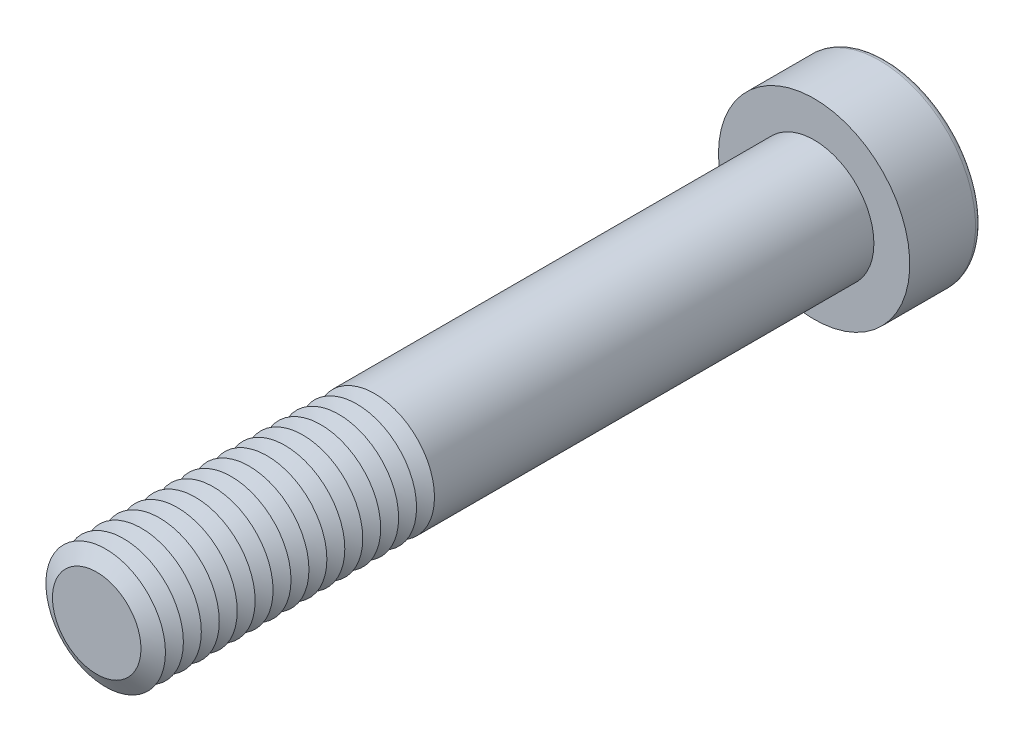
ISO-10303-21;
HEADER;
FILE_DESCRIPTION(('STEP AP214'),'2;1');
FILE_NAME('part.step','',(''),(''),'','','');
FILE_SCHEMA(('AUTOMOTIVE_DESIGN { 1 0 10303 214 1 1 1 1 }'));
ENDSEC;
DATA;
#1=APPLICATION_CONTEXT('core data for automotive mechanical design processes');
#2=APPLICATION_PROTOCOL_DEFINITION('international standard','automotive_design',2000,#1);
#3=PRODUCT_CONTEXT('',#1,'mechanical');
#4=PRODUCT('Part','Part','',(#3));
#5=PRODUCT_RELATED_PRODUCT_CATEGORY('part','',(#4));
#6=PRODUCT_DEFINITION_FORMATION('','',#4);
#7=PRODUCT_DEFINITION_CONTEXT('part definition',#1,'design');
#8=PRODUCT_DEFINITION('design','',#6,#7);
#9=PRODUCT_DEFINITION_SHAPE('','',#8);
#10=(LENGTH_UNIT() NAMED_UNIT(*) SI_UNIT(.MILLI.,.METRE.));
#11=(NAMED_UNIT(*) PLANE_ANGLE_UNIT() SI_UNIT($,.RADIAN.));
#12=(NAMED_UNIT(*) SI_UNIT($,.STERADIAN.) SOLID_ANGLE_UNIT());
#13=UNCERTAINTY_MEASURE_WITH_UNIT(LENGTH_MEASURE(1.E-05),#10,'distance_accuracy_value','');
#14=(GEOMETRIC_REPRESENTATION_CONTEXT(3) GLOBAL_UNCERTAINTY_ASSIGNED_CONTEXT((#13)) GLOBAL_UNIT_ASSIGNED_CONTEXT((#10,
#11,#12)) REPRESENTATION_CONTEXT('',''));
#15=CARTESIAN_POINT('',(0.,0.,0.));
#16=DIRECTION('',(0.,0.,1.));
#17=DIRECTION('',(1.,0.,0.));
#18=AXIS2_PLACEMENT_3D('',#15,#16,#17);
#19=CARTESIAN_POINT('',(0.,0.,54.75));
#20=DIRECTION('',(0.,0.,1.));
#21=DIRECTION('',(1.,0.,0.));
#22=AXIS2_PLACEMENT_3D('',#19,#20,#21);
#23=CONICAL_SURFACE('',#22,5.,1.0471975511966);
#24=CARTESIAN_POINT('',(0.,0.,54.));
#25=DIRECTION('',(0.,0.,1.));
#26=DIRECTION('',(1.,0.,0.));
#27=AXIS2_PLACEMENT_3D('',#24,#25,#26);
#28=CIRCLE('',#27,3.70096189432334);
#29=CARTESIAN_POINT('',(3.70096189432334,0.,54.));
#30=VERTEX_POINT('',#29);
#31=EDGE_CURVE('E313',#30,#30,#28,.T.);
#32=ORIENTED_EDGE('',*,*,#31,.T.);
#33=EDGE_LOOP('',(#32));
#34=FACE_BOUND('',#33,.T.);
#35=CARTESIAN_POINT('',(0.,0.,54.75));
#36=DIRECTION('',(0.,0.,1.));
#37=DIRECTION('',(1.,0.,0.));
#38=AXIS2_PLACEMENT_3D('',#35,#36,#37);
#39=CIRCLE('',#38,5.);
#40=CARTESIAN_POINT('',(5.,0.,54.75));
#41=VERTEX_POINT('',#40);
#42=EDGE_CURVE('E316',#41,#41,#39,.T.);
#43=ORIENTED_EDGE('',*,*,#42,.F.);
#44=EDGE_LOOP('',(#43));
#45=FACE_BOUND('',#44,.T.);
#46=ADVANCED_FACE('F39',(#34,#45),#23,.T.);
#47=CARTESIAN_POINT('',(0.,0.,54.));
#48=DIRECTION('',(0.,0.,-1.));
#49=DIRECTION('',(-1.,0.,0.));
#50=AXIS2_PLACEMENT_3D('',#47,#48,#49);
#51=CONICAL_SURFACE('',#50,3.70096189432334,1.0471975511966);
#52=CARTESIAN_POINT('',(0.,0.,53.25));
#53=DIRECTION('',(0.,0.,1.));
#54=DIRECTION('',(1.,0.,0.));
#55=AXIS2_PLACEMENT_3D('',#52,#53,#54);
#56=CIRCLE('',#55,5.);
#57=CARTESIAN_POINT('',(5.,0.,53.25));
#58=VERTEX_POINT('',#57);
#59=EDGE_CURVE('E324',#58,#58,#56,.T.);
#60=ORIENTED_EDGE('',*,*,#59,.T.);
#61=EDGE_LOOP('',(#60));
#62=FACE_BOUND('',#61,.T.);
#63=ORIENTED_EDGE('',*,*,#31,.F.);
#64=EDGE_LOOP('',(#63));
#65=FACE_BOUND('',#64,.T.);
#66=ADVANCED_FACE('F244',(#62,#65),#51,.T.);
#67=CARTESIAN_POINT('',(0.,0.,60.));
#68=DIRECTION('',(0.,0.,1.));
#69=DIRECTION('',(1.,0.,0.));
#70=AXIS2_PLACEMENT_3D('',#67,#68,#69);
#71=PLANE('',#70);
#72=CARTESIAN_POINT('',(0.,0.,60.));
#73=DIRECTION('',(0.,0.,1.));
#74=DIRECTION('',(1.,0.,0.));
#75=AXIS2_PLACEMENT_3D('',#72,#73,#74);
#76=CIRCLE('',#75,3.70096189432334);
#77=CARTESIAN_POINT('',(3.70096189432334,0.,60.));
#78=VERTEX_POINT('',#77);
#79=EDGE_CURVE('E173',#78,#78,#76,.T.);
#80=ORIENTED_EDGE('',*,*,#79,.T.);
#81=EDGE_LOOP('',(#80));
#82=FACE_BOUND('',#81,.T.);
#83=ADVANCED_FACE('F250',(#82),#71,.T.);
#84=CARTESIAN_POINT('',(0.,0.,60.));
#85=DIRECTION('',(0.,0.,-1.));
#86=DIRECTION('',(-1.,0.,0.));
#87=AXIS2_PLACEMENT_3D('',#84,#85,#86);
#88=CONICAL_SURFACE('',#87,3.70096189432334,1.0471975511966);
#89=CARTESIAN_POINT('',(0.,0.,59.25));
#90=DIRECTION('',(0.,0.,1.));
#91=DIRECTION('',(1.,0.,0.));
#92=AXIS2_PLACEMENT_3D('',#89,#90,#91);
#93=CIRCLE('',#92,5.);
#94=CARTESIAN_POINT('',(5.,0.,59.25));
#95=VERTEX_POINT('',#94);
#96=EDGE_CURVE('E290',#95,#95,#93,.T.);
#97=ORIENTED_EDGE('',*,*,#96,.T.);
#98=EDGE_LOOP('',(#97));
#99=FACE_BOUND('',#98,.T.);
#100=ORIENTED_EDGE('',*,*,#79,.F.);
#101=EDGE_LOOP('',(#100));
#102=FACE_BOUND('',#101,.T.);
#103=ADVANCED_FACE('F198',(#99,#102),#88,.T.);
#104=CARTESIAN_POINT('',(0.,0.,59.25));
#105=DIRECTION('',(0.,0.,1.));
#106=DIRECTION('',(1.,0.,0.));
#107=AXIS2_PLACEMENT_3D('',#104,#105,#106);
#108=CONICAL_SURFACE('',#107,5.,1.0471975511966);
#109=CARTESIAN_POINT('',(0.,0.,58.5));
#110=DIRECTION('',(0.,0.,1.));
#111=DIRECTION('',(1.,0.,0.));
#112=AXIS2_PLACEMENT_3D('',#109,#110,#111);
#113=CIRCLE('',#112,3.70096189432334);
#114=CARTESIAN_POINT('',(3.70096189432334,0.,58.5));
#115=VERTEX_POINT('',#114);
#116=EDGE_CURVE('E287',#115,#115,#113,.T.);
#117=ORIENTED_EDGE('',*,*,#116,.T.);
#118=EDGE_LOOP('',(#117));
#119=FACE_BOUND('',#118,.T.);
#120=ORIENTED_EDGE('',*,*,#96,.F.);
#121=EDGE_LOOP('',(#120));
#122=FACE_BOUND('',#121,.T.);
#123=ADVANCED_FACE('F276',(#119,#122),#108,.T.);
#124=CARTESIAN_POINT('',(0.,0.,58.5));
#125=DIRECTION('',(0.,0.,-1.));
#126=DIRECTION('',(-1.,0.,0.));
#127=AXIS2_PLACEMENT_3D('',#124,#125,#126);
#128=CONICAL_SURFACE('',#127,3.70096189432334,1.0471975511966);
#129=CARTESIAN_POINT('',(0.,0.,57.75));
#130=DIRECTION('',(0.,0.,1.));
#131=DIRECTION('',(1.,0.,0.));
#132=AXIS2_PLACEMENT_3D('',#129,#130,#131);
#133=CIRCLE('',#132,5.);
#134=CARTESIAN_POINT('',(5.,0.,57.75));
#135=VERTEX_POINT('',#134);
#136=EDGE_CURVE('E299',#135,#135,#133,.T.);
#137=ORIENTED_EDGE('',*,*,#136,.T.);
#138=EDGE_LOOP('',(#137));
#139=FACE_BOUND('',#138,.T.);
#140=ORIENTED_EDGE('',*,*,#116,.F.);
#141=EDGE_LOOP('',(#140));
#142=FACE_BOUND('',#141,.T.);
#143=ADVANCED_FACE('F273',(#139,#142),#128,.T.);
#144=CARTESIAN_POINT('',(0.,0.,57.75));
#145=DIRECTION('',(0.,0.,1.));
#146=DIRECTION('',(1.,0.,0.));
#147=AXIS2_PLACEMENT_3D('',#144,#145,#146);
#148=CONICAL_SURFACE('',#147,5.,1.0471975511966);
#149=CARTESIAN_POINT('',(0.,0.,57.));
#150=DIRECTION('',(0.,0.,1.));
#151=DIRECTION('',(1.,0.,0.));
#152=AXIS2_PLACEMENT_3D('',#149,#150,#151);
#153=CIRCLE('',#152,3.70096189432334);
#154=CARTESIAN_POINT('',(3.70096189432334,0.,57.));
#155=VERTEX_POINT('',#154);
#156=EDGE_CURVE('E292',#155,#155,#153,.T.);
#157=ORIENTED_EDGE('',*,*,#156,.T.);
#158=EDGE_LOOP('',(#157));
#159=FACE_BOUND('',#158,.T.);
#160=ORIENTED_EDGE('',*,*,#136,.F.);
#161=EDGE_LOOP('',(#160));
#162=FACE_BOUND('',#161,.T.);
#163=ADVANCED_FACE('F269',(#159,#162),#148,.T.);
#164=CARTESIAN_POINT('',(0.,0.,57.));
#165=DIRECTION('',(0.,0.,-1.));
#166=DIRECTION('',(-1.,0.,0.));
#167=AXIS2_PLACEMENT_3D('',#164,#165,#166);
#168=CONICAL_SURFACE('',#167,3.70096189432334,1.0471975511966);
#169=CARTESIAN_POINT('',(0.,0.,56.25));
#170=DIRECTION('',(0.,0.,1.));
#171=DIRECTION('',(1.,0.,0.));
#172=AXIS2_PLACEMENT_3D('',#169,#170,#171);
#173=CIRCLE('',#172,5.);
#174=CARTESIAN_POINT('',(5.,0.,56.25));
#175=VERTEX_POINT('',#174);
#176=EDGE_CURVE('E309',#175,#175,#173,.T.);
#177=ORIENTED_EDGE('',*,*,#176,.T.);
#178=EDGE_LOOP('',(#177));
#179=FACE_BOUND('',#178,.T.);
#180=ORIENTED_EDGE('',*,*,#156,.F.);
#181=EDGE_LOOP('',(#180));
#182=FACE_BOUND('',#181,.T.);
#183=ADVANCED_FACE('F265',(#179,#182),#168,.T.);
#184=CARTESIAN_POINT('',(0.,0.,56.25));
#185=DIRECTION('',(0.,0.,1.));
#186=DIRECTION('',(1.,0.,0.));
#187=AXIS2_PLACEMENT_3D('',#184,#185,#186);
#188=CONICAL_SURFACE('',#187,5.,1.0471975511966);
#189=CARTESIAN_POINT('',(0.,0.,55.5));
#190=DIRECTION('',(0.,0.,1.));
#191=DIRECTION('',(1.,0.,0.));
#192=AXIS2_PLACEMENT_3D('',#189,#190,#191);
#193=CIRCLE('',#192,3.70096189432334);
#194=CARTESIAN_POINT('',(3.70096189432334,0.,55.5));
#195=VERTEX_POINT('',#194);
#196=EDGE_CURVE('E305',#195,#195,#193,.T.);
#197=ORIENTED_EDGE('',*,*,#196,.T.);
#198=EDGE_LOOP('',(#197));
#199=FACE_BOUND('',#198,.T.);
#200=ORIENTED_EDGE('',*,*,#176,.F.);
#201=EDGE_LOOP('',(#200));
#202=FACE_BOUND('',#201,.T.);
#203=ADVANCED_FACE('F261',(#199,#202),#188,.T.);
#204=CARTESIAN_POINT('',(0.,0.,55.5));
#205=DIRECTION('',(0.,0.,-1.));
#206=DIRECTION('',(-1.,0.,0.));
#207=AXIS2_PLACEMENT_3D('',#204,#205,#206);
#208=CONICAL_SURFACE('',#207,3.70096189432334,1.0471975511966);
#209=ORIENTED_EDGE('',*,*,#42,.T.);
#210=EDGE_LOOP('',(#209));
#211=FACE_BOUND('',#210,.T.);
#212=ORIENTED_EDGE('',*,*,#196,.F.);
#213=EDGE_LOOP('',(#212));
#214=FACE_BOUND('',#213,.T.);
#215=ADVANCED_FACE('F257',(#211,#214),#208,.T.);
#216=CARTESIAN_POINT('',(0.,0.,53.25));
#217=DIRECTION('',(0.,0.,1.));
#218=DIRECTION('',(1.,0.,0.));
#219=AXIS2_PLACEMENT_3D('',#216,#217,#218);
#220=CONICAL_SURFACE('',#219,5.,1.0471975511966);
#221=CARTESIAN_POINT('',(0.,0.,52.5));
#222=DIRECTION('',(0.,0.,1.));
#223=DIRECTION('',(1.,0.,0.));
#224=AXIS2_PLACEMENT_3D('',#221,#222,#223);
#225=CIRCLE('',#224,3.70096189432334);
#226=CARTESIAN_POINT('',(3.70096189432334,0.,52.5));
#227=VERTEX_POINT('',#226);
#228=EDGE_CURVE('E320',#227,#227,#225,.T.);
#229=ORIENTED_EDGE('',*,*,#228,.T.);
#230=EDGE_LOOP('',(#229));
#231=FACE_BOUND('',#230,.T.);
#232=ORIENTED_EDGE('',*,*,#59,.F.);
#233=EDGE_LOOP('',(#232));
#234=FACE_BOUND('',#233,.T.);
#235=ADVANCED_FACE('F260',(#231,#234),#220,.T.);
#236=CARTESIAN_POINT('',(0.,0.,52.5));
#237=DIRECTION('',(0.,0.,-1.));
#238=DIRECTION('',(-1.,0.,0.));
#239=AXIS2_PLACEMENT_3D('',#236,#237,#238);
#240=CONICAL_SURFACE('',#239,3.70096189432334,1.0471975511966);
#241=CARTESIAN_POINT('',(0.,0.,51.75));
#242=DIRECTION('',(0.,0.,1.));
#243=DIRECTION('',(1.,0.,0.));
#244=AXIS2_PLACEMENT_3D('',#241,#242,#243);
#245=CIRCLE('',#244,5.);
#246=CARTESIAN_POINT('',(5.,0.,51.75));
#247=VERTEX_POINT('',#246);
#248=EDGE_CURVE('E332',#247,#247,#245,.T.);
#249=ORIENTED_EDGE('',*,*,#248,.T.);
#250=EDGE_LOOP('',(#249));
#251=FACE_BOUND('',#250,.T.);
#252=ORIENTED_EDGE('',*,*,#228,.F.);
#253=EDGE_LOOP('',(#252));
#254=FACE_BOUND('',#253,.T.);
#255=ADVANCED_FACE('F494',(#251,#254),#240,.T.);
#256=CARTESIAN_POINT('',(0.,0.,51.75));
#257=DIRECTION('',(0.,0.,1.));
#258=DIRECTION('',(1.,0.,0.));
#259=AXIS2_PLACEMENT_3D('',#256,#257,#258);
#260=CONICAL_SURFACE('',#259,5.,1.0471975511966);
#261=CARTESIAN_POINT('',(0.,0.,51.));
#262=DIRECTION('',(0.,0.,1.));
#263=DIRECTION('',(1.,0.,0.));
#264=AXIS2_PLACEMENT_3D('',#261,#262,#263);
#265=CIRCLE('',#264,3.70096189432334);
#266=CARTESIAN_POINT('',(3.70096189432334,0.,51.));
#267=VERTEX_POINT('',#266);
#268=EDGE_CURVE('E328',#267,#267,#265,.T.);
#269=ORIENTED_EDGE('',*,*,#268,.T.);
#270=EDGE_LOOP('',(#269));
#271=FACE_BOUND('',#270,.T.);
#272=ORIENTED_EDGE('',*,*,#248,.F.);
#273=EDGE_LOOP('',(#272));
#274=FACE_BOUND('',#273,.T.);
#275=ADVANCED_FACE('F490',(#271,#274),#260,.T.);
#276=CARTESIAN_POINT('',(0.,0.,51.));
#277=DIRECTION('',(0.,0.,-1.));
#278=DIRECTION('',(-1.,0.,0.));
#279=AXIS2_PLACEMENT_3D('',#276,#277,#278);
#280=CONICAL_SURFACE('',#279,3.70096189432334,1.0471975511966);
#281=CARTESIAN_POINT('',(0.,0.,50.25));
#282=DIRECTION('',(0.,0.,1.));
#283=DIRECTION('',(1.,0.,0.));
#284=AXIS2_PLACEMENT_3D('',#281,#282,#283);
#285=CIRCLE('',#284,5.);
#286=CARTESIAN_POINT('',(5.,0.,50.25));
#287=VERTEX_POINT('',#286);
#288=EDGE_CURVE('E340',#287,#287,#285,.T.);
#289=ORIENTED_EDGE('',*,*,#288,.T.);
#290=EDGE_LOOP('',(#289));
#291=FACE_BOUND('',#290,.T.);
#292=ORIENTED_EDGE('',*,*,#268,.F.);
#293=EDGE_LOOP('',(#292));
#294=FACE_BOUND('',#293,.T.);
#295=ADVANCED_FACE('F486',(#291,#294),#280,.T.);
#296=CARTESIAN_POINT('',(0.,0.,50.25));
#297=DIRECTION('',(0.,0.,1.));
#298=DIRECTION('',(1.,0.,0.));
#299=AXIS2_PLACEMENT_3D('',#296,#297,#298);
#300=CONICAL_SURFACE('',#299,5.,1.0471975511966);
#301=CARTESIAN_POINT('',(0.,0.,49.5));
#302=DIRECTION('',(0.,0.,1.));
#303=DIRECTION('',(1.,0.,0.));
#304=AXIS2_PLACEMENT_3D('',#301,#302,#303);
#305=CIRCLE('',#304,3.70096189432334);
#306=CARTESIAN_POINT('',(3.70096189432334,0.,49.5));
#307=VERTEX_POINT('',#306);
#308=EDGE_CURVE('E336',#307,#307,#305,.T.);
#309=ORIENTED_EDGE('',*,*,#308,.T.);
#310=EDGE_LOOP('',(#309));
#311=FACE_BOUND('',#310,.T.);
#312=ORIENTED_EDGE('',*,*,#288,.F.);
#313=EDGE_LOOP('',(#312));
#314=FACE_BOUND('',#313,.T.);
#315=ADVANCED_FACE('F482',(#311,#314),#300,.T.);
#316=CARTESIAN_POINT('',(0.,0.,49.5));
#317=DIRECTION('',(0.,0.,-1.));
#318=DIRECTION('',(-1.,0.,0.));
#319=AXIS2_PLACEMENT_3D('',#316,#317,#318);
#320=CONICAL_SURFACE('',#319,3.70096189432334,1.0471975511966);
#321=CARTESIAN_POINT('',(0.,0.,48.75));
#322=DIRECTION('',(0.,0.,1.));
#323=DIRECTION('',(1.,0.,0.));
#324=AXIS2_PLACEMENT_3D('',#321,#322,#323);
#325=CIRCLE('',#324,5.);
#326=CARTESIAN_POINT('',(5.,0.,48.75));
#327=VERTEX_POINT('',#326);
#328=EDGE_CURVE('E348',#327,#327,#325,.T.);
#329=ORIENTED_EDGE('',*,*,#328,.T.);
#330=EDGE_LOOP('',(#329));
#331=FACE_BOUND('',#330,.T.);
#332=ORIENTED_EDGE('',*,*,#308,.F.);
#333=EDGE_LOOP('',(#332));
#334=FACE_BOUND('',#333,.T.);
#335=ADVANCED_FACE('F478',(#331,#334),#320,.T.);
#336=CARTESIAN_POINT('',(0.,0.,48.75));
#337=DIRECTION('',(0.,0.,1.));
#338=DIRECTION('',(1.,0.,0.));
#339=AXIS2_PLACEMENT_3D('',#336,#337,#338);
#340=CONICAL_SURFACE('',#339,5.,1.0471975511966);
#341=CARTESIAN_POINT('',(0.,0.,48.));
#342=DIRECTION('',(0.,0.,1.));
#343=DIRECTION('',(1.,0.,0.));
#344=AXIS2_PLACEMENT_3D('',#341,#342,#343);
#345=CIRCLE('',#344,3.70096189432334);
#346=CARTESIAN_POINT('',(3.70096189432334,0.,48.));
#347=VERTEX_POINT('',#346);
#348=EDGE_CURVE('E344',#347,#347,#345,.T.);
#349=ORIENTED_EDGE('',*,*,#348,.T.);
#350=EDGE_LOOP('',(#349));
#351=FACE_BOUND('',#350,.T.);
#352=ORIENTED_EDGE('',*,*,#328,.F.);
#353=EDGE_LOOP('',(#352));
#354=FACE_BOUND('',#353,.T.);
#355=ADVANCED_FACE('F474',(#351,#354),#340,.T.);
#356=CARTESIAN_POINT('',(0.,0.,48.));
#357=DIRECTION('',(0.,0.,-1.));
#358=DIRECTION('',(-1.,0.,0.));
#359=AXIS2_PLACEMENT_3D('',#356,#357,#358);
#360=CONICAL_SURFACE('',#359,3.70096189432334,1.0471975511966);
#361=CARTESIAN_POINT('',(0.,0.,47.25));
#362=DIRECTION('',(0.,0.,1.));
#363=DIRECTION('',(1.,0.,0.));
#364=AXIS2_PLACEMENT_3D('',#361,#362,#363);
#365=CIRCLE('',#364,5.);
#366=CARTESIAN_POINT('',(5.,0.,47.25));
#367=VERTEX_POINT('',#366);
#368=EDGE_CURVE('E355',#367,#367,#365,.T.);
#369=ORIENTED_EDGE('',*,*,#368,.T.);
#370=EDGE_LOOP('',(#369));
#371=FACE_BOUND('',#370,.T.);
#372=ORIENTED_EDGE('',*,*,#348,.F.);
#373=EDGE_LOOP('',(#372));
#374=FACE_BOUND('',#373,.T.);
#375=ADVANCED_FACE('F470',(#371,#374),#360,.T.);
#376=CARTESIAN_POINT('',(0.,0.,47.25));
#377=DIRECTION('',(0.,0.,1.));
#378=DIRECTION('',(1.,0.,0.));
#379=AXIS2_PLACEMENT_3D('',#376,#377,#378);
#380=CONICAL_SURFACE('',#379,5.,1.0471975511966);
#381=CARTESIAN_POINT('',(0.,0.,46.5));
#382=DIRECTION('',(0.,0.,1.));
#383=DIRECTION('',(1.,0.,0.));
#384=AXIS2_PLACEMENT_3D('',#381,#382,#383);
#385=CIRCLE('',#384,3.70096189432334);
#386=CARTESIAN_POINT('',(3.70096189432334,0.,46.5));
#387=VERTEX_POINT('',#386);
#388=EDGE_CURVE('E352',#387,#387,#385,.T.);
#389=ORIENTED_EDGE('',*,*,#388,.T.);
#390=EDGE_LOOP('',(#389));
#391=FACE_BOUND('',#390,.T.);
#392=ORIENTED_EDGE('',*,*,#368,.F.);
#393=EDGE_LOOP('',(#392));
#394=FACE_BOUND('',#393,.T.);
#395=ADVANCED_FACE('F466',(#391,#394),#380,.T.);
#396=CARTESIAN_POINT('',(0.,0.,46.5));
#397=DIRECTION('',(0.,0.,-1.));
#398=DIRECTION('',(-1.,0.,0.));
#399=AXIS2_PLACEMENT_3D('',#396,#397,#398);
#400=CONICAL_SURFACE('',#399,3.70096189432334,1.0471975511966);
#401=CARTESIAN_POINT('',(0.,0.,45.75));
#402=DIRECTION('',(0.,0.,1.));
#403=DIRECTION('',(1.,0.,0.));
#404=AXIS2_PLACEMENT_3D('',#401,#402,#403);
#405=CIRCLE('',#404,5.);
#406=CARTESIAN_POINT('',(5.,0.,45.75));
#407=VERTEX_POINT('',#406);
#408=EDGE_CURVE('E362',#407,#407,#405,.T.);
#409=ORIENTED_EDGE('',*,*,#408,.T.);
#410=EDGE_LOOP('',(#409));
#411=FACE_BOUND('',#410,.T.);
#412=ORIENTED_EDGE('',*,*,#388,.F.);
#413=EDGE_LOOP('',(#412));
#414=FACE_BOUND('',#413,.T.);
#415=ADVANCED_FACE('F462',(#411,#414),#400,.T.);
#416=CARTESIAN_POINT('',(0.,0.,45.75));
#417=DIRECTION('',(0.,0.,1.));
#418=DIRECTION('',(1.,0.,0.));
#419=AXIS2_PLACEMENT_3D('',#416,#417,#418);
#420=CONICAL_SURFACE('',#419,5.,1.0471975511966);
#421=CARTESIAN_POINT('',(0.,0.,45.));
#422=DIRECTION('',(0.,0.,1.));
#423=DIRECTION('',(1.,0.,0.));
#424=AXIS2_PLACEMENT_3D('',#421,#422,#423);
#425=CIRCLE('',#424,3.70096189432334);
#426=CARTESIAN_POINT('',(3.70096189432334,0.,45.));
#427=VERTEX_POINT('',#426);
#428=EDGE_CURVE('E358',#427,#427,#425,.T.);
#429=ORIENTED_EDGE('',*,*,#428,.T.);
#430=EDGE_LOOP('',(#429));
#431=FACE_BOUND('',#430,.T.);
#432=ORIENTED_EDGE('',*,*,#408,.F.);
#433=EDGE_LOOP('',(#432));
#434=FACE_BOUND('',#433,.T.);
#435=ADVANCED_FACE('F458',(#431,#434),#420,.T.);
#436=CARTESIAN_POINT('',(0.,0.,45.));
#437=DIRECTION('',(0.,0.,-1.));
#438=DIRECTION('',(-1.,0.,0.));
#439=AXIS2_PLACEMENT_3D('',#436,#437,#438);
#440=CONICAL_SURFACE('',#439,3.70096189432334,1.0471975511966);
#441=CARTESIAN_POINT('',(0.,0.,44.25));
#442=DIRECTION('',(0.,0.,1.));
#443=DIRECTION('',(1.,0.,0.));
#444=AXIS2_PLACEMENT_3D('',#441,#442,#443);
#445=CIRCLE('',#444,5.);
#446=CARTESIAN_POINT('',(5.,0.,44.25));
#447=VERTEX_POINT('',#446);
#448=EDGE_CURVE('E370',#447,#447,#445,.T.);
#449=ORIENTED_EDGE('',*,*,#448,.T.);
#450=EDGE_LOOP('',(#449));
#451=FACE_BOUND('',#450,.T.);
#452=ORIENTED_EDGE('',*,*,#428,.F.);
#453=EDGE_LOOP('',(#452));
#454=FACE_BOUND('',#453,.T.);
#455=ADVANCED_FACE('F454',(#451,#454),#440,.T.);
#456=CARTESIAN_POINT('',(0.,0.,44.25));
#457=DIRECTION('',(0.,0.,1.));
#458=DIRECTION('',(1.,0.,0.));
#459=AXIS2_PLACEMENT_3D('',#456,#457,#458);
#460=CONICAL_SURFACE('',#459,5.,1.0471975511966);
#461=CARTESIAN_POINT('',(0.,0.,43.5));
#462=DIRECTION('',(0.,0.,1.));
#463=DIRECTION('',(1.,0.,0.));
#464=AXIS2_PLACEMENT_3D('',#461,#462,#463);
#465=CIRCLE('',#464,3.70096189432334);
#466=CARTESIAN_POINT('',(3.70096189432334,0.,43.5));
#467=VERTEX_POINT('',#466);
#468=EDGE_CURVE('E366',#467,#467,#465,.T.);
#469=ORIENTED_EDGE('',*,*,#468,.T.);
#470=EDGE_LOOP('',(#469));
#471=FACE_BOUND('',#470,.T.);
#472=ORIENTED_EDGE('',*,*,#448,.F.);
#473=EDGE_LOOP('',(#472));
#474=FACE_BOUND('',#473,.T.);
#475=ADVANCED_FACE('F450',(#471,#474),#460,.T.);
#476=CARTESIAN_POINT('',(0.,0.,43.5));
#477=DIRECTION('',(0.,0.,-1.));
#478=DIRECTION('',(-1.,0.,0.));
#479=AXIS2_PLACEMENT_3D('',#476,#477,#478);
#480=CONICAL_SURFACE('',#479,3.70096189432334,1.0471975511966);
#481=CARTESIAN_POINT('',(0.,0.,42.75));
#482=DIRECTION('',(0.,0.,1.));
#483=DIRECTION('',(1.,0.,0.));
#484=AXIS2_PLACEMENT_3D('',#481,#482,#483);
#485=CIRCLE('',#484,5.);
#486=CARTESIAN_POINT('',(5.,0.,42.75));
#487=VERTEX_POINT('',#486);
#488=EDGE_CURVE('E378',#487,#487,#485,.T.);
#489=ORIENTED_EDGE('',*,*,#488,.T.);
#490=EDGE_LOOP('',(#489));
#491=FACE_BOUND('',#490,.T.);
#492=ORIENTED_EDGE('',*,*,#468,.F.);
#493=EDGE_LOOP('',(#492));
#494=FACE_BOUND('',#493,.T.);
#495=ADVANCED_FACE('F446',(#491,#494),#480,.T.);
#496=CARTESIAN_POINT('',(0.,0.,42.75));
#497=DIRECTION('',(0.,0.,1.));
#498=DIRECTION('',(1.,0.,0.));
#499=AXIS2_PLACEMENT_3D('',#496,#497,#498);
#500=CONICAL_SURFACE('',#499,5.,1.0471975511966);
#501=CARTESIAN_POINT('',(0.,0.,42.));
#502=DIRECTION('',(0.,0.,1.));
#503=DIRECTION('',(1.,0.,0.));
#504=AXIS2_PLACEMENT_3D('',#501,#502,#503);
#505=CIRCLE('',#504,3.70096189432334);
#506=CARTESIAN_POINT('',(3.70096189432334,0.,42.));
#507=VERTEX_POINT('',#506);
#508=EDGE_CURVE('E374',#507,#507,#505,.T.);
#509=ORIENTED_EDGE('',*,*,#508,.T.);
#510=EDGE_LOOP('',(#509));
#511=FACE_BOUND('',#510,.T.);
#512=ORIENTED_EDGE('',*,*,#488,.F.);
#513=EDGE_LOOP('',(#512));
#514=FACE_BOUND('',#513,.T.);
#515=ADVANCED_FACE('F442',(#511,#514),#500,.T.);
#516=CARTESIAN_POINT('',(0.,0.,42.));
#517=DIRECTION('',(0.,0.,-1.));
#518=DIRECTION('',(-1.,0.,0.));
#519=AXIS2_PLACEMENT_3D('',#516,#517,#518);
#520=CONICAL_SURFACE('',#519,3.70096189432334,1.0471975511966);
#521=CARTESIAN_POINT('',(0.,0.,41.25));
#522=DIRECTION('',(0.,0.,1.));
#523=DIRECTION('',(1.,0.,0.));
#524=AXIS2_PLACEMENT_3D('',#521,#522,#523);
#525=CIRCLE('',#524,5.);
#526=CARTESIAN_POINT('',(5.,0.,41.25));
#527=VERTEX_POINT('',#526);
#528=EDGE_CURVE('E386',#527,#527,#525,.T.);
#529=ORIENTED_EDGE('',*,*,#528,.T.);
#530=EDGE_LOOP('',(#529));
#531=FACE_BOUND('',#530,.T.);
#532=ORIENTED_EDGE('',*,*,#508,.F.);
#533=EDGE_LOOP('',(#532));
#534=FACE_BOUND('',#533,.T.);
#535=ADVANCED_FACE('F438',(#531,#534),#520,.T.);
#536=CARTESIAN_POINT('',(0.,0.,41.25));
#537=DIRECTION('',(0.,0.,1.));
#538=DIRECTION('',(1.,0.,0.));
#539=AXIS2_PLACEMENT_3D('',#536,#537,#538);
#540=CONICAL_SURFACE('',#539,5.,1.0471975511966);
#541=CARTESIAN_POINT('',(0.,0.,40.5));
#542=DIRECTION('',(0.,0.,1.));
#543=DIRECTION('',(1.,0.,0.));
#544=AXIS2_PLACEMENT_3D('',#541,#542,#543);
#545=CIRCLE('',#544,3.70096189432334);
#546=CARTESIAN_POINT('',(3.70096189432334,0.,40.5));
#547=VERTEX_POINT('',#546);
#548=EDGE_CURVE('E382',#547,#547,#545,.T.);
#549=ORIENTED_EDGE('',*,*,#548,.T.);
#550=EDGE_LOOP('',(#549));
#551=FACE_BOUND('',#550,.T.);
#552=ORIENTED_EDGE('',*,*,#528,.F.);
#553=EDGE_LOOP('',(#552));
#554=FACE_BOUND('',#553,.T.);
#555=ADVANCED_FACE('F434',(#551,#554),#540,.T.);
#556=CARTESIAN_POINT('',(0.,0.,40.5));
#557=DIRECTION('',(0.,0.,-1.));
#558=DIRECTION('',(-1.,0.,0.));
#559=AXIS2_PLACEMENT_3D('',#556,#557,#558);
#560=CONICAL_SURFACE('',#559,3.70096189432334,1.0471975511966);
#561=CARTESIAN_POINT('',(0.,0.,39.75));
#562=DIRECTION('',(0.,0.,1.));
#563=DIRECTION('',(1.,0.,0.));
#564=AXIS2_PLACEMENT_3D('',#561,#562,#563);
#565=CIRCLE('',#564,5.);
#566=CARTESIAN_POINT('',(5.,0.,39.75));
#567=VERTEX_POINT('',#566);
#568=EDGE_CURVE('E394',#567,#567,#565,.T.);
#569=ORIENTED_EDGE('',*,*,#568,.T.);
#570=EDGE_LOOP('',(#569));
#571=FACE_BOUND('',#570,.T.);
#572=ORIENTED_EDGE('',*,*,#548,.F.);
#573=EDGE_LOOP('',(#572));
#574=FACE_BOUND('',#573,.T.);
#575=ADVANCED_FACE('F430',(#571,#574),#560,.T.);
#576=CARTESIAN_POINT('',(0.,0.,39.75));
#577=DIRECTION('',(0.,0.,1.));
#578=DIRECTION('',(1.,0.,0.));
#579=AXIS2_PLACEMENT_3D('',#576,#577,#578);
#580=CONICAL_SURFACE('',#579,5.,1.0471975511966);
#581=CARTESIAN_POINT('',(0.,0.,39.));
#582=DIRECTION('',(0.,0.,1.));
#583=DIRECTION('',(1.,0.,0.));
#584=AXIS2_PLACEMENT_3D('',#581,#582,#583);
#585=CIRCLE('',#584,3.70096189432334);
#586=CARTESIAN_POINT('',(3.70096189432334,0.,39.));
#587=VERTEX_POINT('',#586);
#588=EDGE_CURVE('E390',#587,#587,#585,.T.);
#589=ORIENTED_EDGE('',*,*,#588,.T.);
#590=EDGE_LOOP('',(#589));
#591=FACE_BOUND('',#590,.T.);
#592=ORIENTED_EDGE('',*,*,#568,.F.);
#593=EDGE_LOOP('',(#592));
#594=FACE_BOUND('',#593,.T.);
#595=ADVANCED_FACE('F425',(#591,#594),#580,.T.);
#596=CARTESIAN_POINT('',(0.,0.,39.));
#597=DIRECTION('',(0.,0.,-1.));
#598=DIRECTION('',(-1.,0.,0.));
#599=AXIS2_PLACEMENT_3D('',#596,#597,#598);
#600=CONICAL_SURFACE('',#599,3.70096189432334,1.0471975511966);
#601=CARTESIAN_POINT('',(0.,0.,38.25));
#602=DIRECTION('',(0.,0.,1.));
#603=DIRECTION('',(1.,0.,0.));
#604=AXIS2_PLACEMENT_3D('',#601,#602,#603);
#605=CIRCLE('',#604,5.);
#606=CARTESIAN_POINT('',(5.,0.,38.25));
#607=VERTEX_POINT('',#606);
#608=EDGE_CURVE('E406',#607,#607,#605,.T.);
#609=ORIENTED_EDGE('',*,*,#608,.T.);
#610=EDGE_LOOP('',(#609));
#611=FACE_BOUND('',#610,.T.);
#612=ORIENTED_EDGE('',*,*,#588,.F.);
#613=EDGE_LOOP('',(#612));
#614=FACE_BOUND('',#613,.T.);
#615=ADVANCED_FACE('F411',(#611,#614),#600,.T.);
#616=CARTESIAN_POINT('',(0.,0.,38.25));
#617=DIRECTION('',(0.,0.,1.));
#618=DIRECTION('',(1.,0.,0.));
#619=AXIS2_PLACEMENT_3D('',#616,#617,#618);
#620=CONICAL_SURFACE('',#619,5.,1.0471975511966);
#621=CARTESIAN_POINT('',(0.,0.,37.5));
#622=DIRECTION('',(0.,0.,1.));
#623=DIRECTION('',(1.,0.,0.));
#624=AXIS2_PLACEMENT_3D('',#621,#622,#623);
#625=CIRCLE('',#624,3.70096189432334);
#626=CARTESIAN_POINT('',(3.70096189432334,0.,37.5));
#627=VERTEX_POINT('',#626);
#628=EDGE_CURVE('E398',#627,#627,#625,.T.);
#629=ORIENTED_EDGE('',*,*,#628,.T.);
#630=EDGE_LOOP('',(#629));
#631=FACE_BOUND('',#630,.T.);
#632=ORIENTED_EDGE('',*,*,#608,.F.);
#633=EDGE_LOOP('',(#632));
#634=FACE_BOUND('',#633,.T.);
#635=ADVANCED_FACE('F414',(#631,#634),#620,.T.);
#636=CARTESIAN_POINT('',(0.,0.,37.5));
#637=DIRECTION('',(0.,0.,-1.));
#638=DIRECTION('',(-1.,0.,0.));
#639=AXIS2_PLACEMENT_3D('',#636,#637,#638);
#640=CONICAL_SURFACE('',#639,3.70096189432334,1.0471975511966);
#641=CARTESIAN_POINT('',(0.,0.,36.75));
#642=DIRECTION('',(0.,0.,1.));
#643=DIRECTION('',(1.,0.,0.));
#644=AXIS2_PLACEMENT_3D('',#641,#642,#643);
#645=CIRCLE('',#644,5.);
#646=CARTESIAN_POINT('',(5.,0.,36.75));
#647=VERTEX_POINT('',#646);
#648=EDGE_CURVE('E402',#647,#647,#645,.T.);
#649=ORIENTED_EDGE('',*,*,#648,.T.);
#650=EDGE_LOOP('',(#649));
#651=FACE_BOUND('',#650,.T.);
#652=ORIENTED_EDGE('',*,*,#628,.F.);
#653=EDGE_LOOP('',(#652));
#654=FACE_BOUND('',#653,.T.);
#655=ADVANCED_FACE('F416',(#651,#654),#640,.T.);
#656=CARTESIAN_POINT('',(0.,0.,-0.75));
#657=DIRECTION('',(0.,0.,-1.));
#658=DIRECTION('',(-1.,0.,0.));
#659=AXIS2_PLACEMENT_3D('',#656,#657,#658);
#660=CONICAL_SURFACE('',#659,3.5,1.0471975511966);
#661=CARTESIAN_POINT('',(0.,0.,1.27072594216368));
#662=VERTEX_POINT('',#661);
#663=VERTEX_LOOP('',#662);
#664=FACE_BOUND('',#663,.T.);
#665=CARTESIAN_POINT('',(0.,0.,-0.75));
#666=DIRECTION('',(0.,0.,-1.));
#667=DIRECTION('',(-1.,0.,0.));
#668=AXIS2_PLACEMENT_3D('',#665,#666,#667);
#669=CIRCLE('',#668,3.5);
#670=CARTESIAN_POINT('',(-3.03108891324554,1.75,-0.75));
#671=VERTEX_POINT('',#670);
#672=CARTESIAN_POINT('',(0.,3.5,-0.75));
#673=VERTEX_POINT('',#672);
#674=EDGE_CURVE('E149',#671,#673,#669,.T.);
#675=ORIENTED_EDGE('',*,*,#674,.T.);
#676=CARTESIAN_POINT('',(0.,0.,-0.75));
#677=DIRECTION('',(0.,0.,-1.));
#678=DIRECTION('',(-1.,0.,0.));
#679=AXIS2_PLACEMENT_3D('',#676,#677,#678);
#680=CIRCLE('',#679,3.5);
#681=CARTESIAN_POINT('',(3.03108891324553,1.75,-0.75));
#682=VERTEX_POINT('',#681);
#683=EDGE_CURVE('E54',#673,#682,#680,.T.);
#684=ORIENTED_EDGE('',*,*,#683,.T.);
#685=CARTESIAN_POINT('',(3.03108891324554,-1.75,-0.75));
#686=VERTEX_POINT('',#685);
#687=EDGE_CURVE('E996',#682,#686,#680,.T.);
#688=ORIENTED_EDGE('',*,*,#687,.T.);
#689=CARTESIAN_POINT('',(0.,-3.5,-0.75));
#690=VERTEX_POINT('',#689);
#691=EDGE_CURVE('E994',#686,#690,#680,.T.);
#692=ORIENTED_EDGE('',*,*,#691,.T.);
#693=CARTESIAN_POINT('',(-3.03108891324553,-1.75,-0.75));
#694=VERTEX_POINT('',#693);
#695=EDGE_CURVE('E988',#690,#694,#680,.T.);
#696=ORIENTED_EDGE('',*,*,#695,.T.);
#697=EDGE_CURVE('E986',#694,#671,#680,.T.);
#698=ORIENTED_EDGE('',*,*,#697,.T.);
#699=EDGE_LOOP('',(#675,#684,#688,#692,#696,#698));
#700=FACE_BOUND('',#699,.T.);
#701=ADVANCED_FACE('F200',(#664,#700),#660,.F.);
#702=CARTESIAN_POINT('',(0.,0.,-0.75));
#703=DIRECTION('',(0.,0.,-1.));
#704=DIRECTION('',(-1.,0.,0.));
#705=AXIS2_PLACEMENT_3D('',#702,#703,#704);
#706=PLANE('',#705);
#707=ORIENTED_EDGE('',*,*,#683,.F.);
#708=DIRECTION('',(1.,0.,0.));
#709=VECTOR('',#708,1.);
#710=CARTESIAN_POINT('',(-2.02072594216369,3.5,-0.75));
#711=LINE('',#710,#709);
#712=CARTESIAN_POINT('',(2.02072594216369,3.5,-0.75));
#713=VERTEX_POINT('',#712);
#714=EDGE_CURVE('E1036',#673,#713,#711,.T.);
#715=ORIENTED_EDGE('',*,*,#714,.T.);
#716=DIRECTION('',(0.5,-0.866025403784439,0.));
#717=VECTOR('',#716,1.);
#718=CARTESIAN_POINT('',(2.02072594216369,3.5,-0.75));
#719=LINE('',#718,#717);
#720=EDGE_CURVE('E155',#713,#682,#719,.T.);
#721=ORIENTED_EDGE('',*,*,#720,.T.);
#722=EDGE_LOOP('',(#707,#715,#721));
#723=FACE_BOUND('',#722,.T.);
#724=ADVANCED_FACE('F583',(#723),#706,.T.);
#725=ORIENTED_EDGE('',*,*,#687,.F.);
#726=CARTESIAN_POINT('',(4.04145188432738,0.,-0.75));
#727=VERTEX_POINT('',#726);
#728=EDGE_CURVE('E1040',#682,#727,#719,.T.);
#729=ORIENTED_EDGE('',*,*,#728,.T.);
#730=DIRECTION('',(-0.5,-0.866025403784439,0.));
#731=VECTOR('',#730,1.);
#732=CARTESIAN_POINT('',(4.04145188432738,0.,-0.75));
#733=LINE('',#732,#731);
#734=EDGE_CURVE('E1010',#727,#686,#733,.T.);
#735=ORIENTED_EDGE('',*,*,#734,.T.);
#736=EDGE_LOOP('',(#725,#729,#735));
#737=FACE_BOUND('',#736,.T.);
#738=ADVANCED_FACE('F593',(#737),#706,.T.);
#739=ORIENTED_EDGE('',*,*,#691,.F.);
#740=CARTESIAN_POINT('',(2.02072594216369,-3.5,-0.75));
#741=VERTEX_POINT('',#740);
#742=EDGE_CURVE('E1012',#686,#741,#733,.T.);
#743=ORIENTED_EDGE('',*,*,#742,.T.);
#744=DIRECTION('',(-1.,0.,0.));
#745=VECTOR('',#744,1.);
#746=CARTESIAN_POINT('',(2.02072594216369,-3.5,-0.75));
#747=LINE('',#746,#745);
#748=EDGE_CURVE('E960',#741,#690,#747,.T.);
#749=ORIENTED_EDGE('',*,*,#748,.T.);
#750=EDGE_LOOP('',(#739,#743,#749));
#751=FACE_BOUND('',#750,.T.);
#752=ADVANCED_FACE('F603',(#751),#706,.T.);
#753=ORIENTED_EDGE('',*,*,#695,.F.);
#754=CARTESIAN_POINT('',(-2.02072594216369,-3.5,-0.75));
#755=VERTEX_POINT('',#754);
#756=EDGE_CURVE('E1006',#690,#755,#747,.T.);
#757=ORIENTED_EDGE('',*,*,#756,.T.);
#758=DIRECTION('',(-0.5,0.866025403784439,0.));
#759=VECTOR('',#758,1.);
#760=CARTESIAN_POINT('',(-2.02072594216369,-3.5,-0.75));
#761=LINE('',#760,#759);
#762=EDGE_CURVE('E1008',#755,#694,#761,.T.);
#763=ORIENTED_EDGE('',*,*,#762,.T.);
#764=EDGE_LOOP('',(#753,#757,#763));
#765=FACE_BOUND('',#764,.T.);
#766=ADVANCED_FACE('F611',(#765),#706,.T.);
#767=ORIENTED_EDGE('',*,*,#697,.F.);
#768=CARTESIAN_POINT('',(-4.04145188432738,0.,-0.75));
#769=VERTEX_POINT('',#768);
#770=EDGE_CURVE('E1014',#694,#769,#761,.T.);
#771=ORIENTED_EDGE('',*,*,#770,.T.);
#772=DIRECTION('',(0.5,0.866025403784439,0.));
#773=VECTOR('',#772,1.);
#774=CARTESIAN_POINT('',(-4.04145188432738,0.,-0.75));
#775=LINE('',#774,#773);
#776=EDGE_CURVE('E158',#769,#671,#775,.T.);
#777=ORIENTED_EDGE('',*,*,#776,.T.);
#778=EDGE_LOOP('',(#767,#771,#777));
#779=FACE_BOUND('',#778,.T.);
#780=ADVANCED_FACE('F230',(#779),#706,.T.);
#781=ORIENTED_EDGE('',*,*,#674,.F.);
#782=CARTESIAN_POINT('',(-2.02072594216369,3.5,-0.75));
#783=VERTEX_POINT('',#782);
#784=EDGE_CURVE('E1021',#671,#783,#775,.T.);
#785=ORIENTED_EDGE('',*,*,#784,.T.);
#786=EDGE_CURVE('E1034',#783,#673,#711,.T.);
#787=ORIENTED_EDGE('',*,*,#786,.T.);
#788=EDGE_LOOP('',(#781,#785,#787));
#789=FACE_BOUND('',#788,.T.);
#790=ADVANCED_FACE('F595',(#789),#706,.T.);
#791=CARTESIAN_POINT('',(-2.02072594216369,3.5,-0.75));
#792=DIRECTION('',(0.,1.,0.));
#793=DIRECTION('',(-1.,0.,0.));
#794=AXIS2_PLACEMENT_3D('',#791,#792,#793);
#795=PLANE('',#794);
#796=DIRECTION('',(0.,0.,-1.));
#797=VECTOR('',#796,1.);
#798=CARTESIAN_POINT('',(-2.02072594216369,3.5,-0.75));
#799=LINE('',#798,#797);
#800=CARTESIAN_POINT('',(-2.02072594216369,3.5,-6.));
#801=VERTEX_POINT('',#800);
#802=EDGE_CURVE('E147',#783,#801,#799,.T.);
#803=ORIENTED_EDGE('',*,*,#802,.T.);
#804=CARTESIAN_POINT('',(-5.27521327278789,3.5,-6.613404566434));
#805=CARTESIAN_POINT('',(-5.11717138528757,3.5,-6.57812703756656));
#806=CARTESIAN_POINT('',(-4.95902873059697,3.5,-6.5432936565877));
#807=CARTESIAN_POINT('',(-4.64249233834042,3.5,-6.47475322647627));
#808=CARTESIAN_POINT('',(-4.48409858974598,3.5,-6.44104622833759));
#809=CARTESIAN_POINT('',(-4.16686075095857,3.5,-6.37496567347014));
#810=CARTESIAN_POINT('',(-4.00801636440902,3.5,-6.34259353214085));
#811=CARTESIAN_POINT('',(-3.68999232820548,3.5,-6.27954992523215));
#812=CARTESIAN_POINT('',(-3.53081268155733,3.5,-6.24887844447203));
#813=CARTESIAN_POINT('',(-3.05545711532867,3.5,-6.16049717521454));
#814=CARTESIAN_POINT('',(-2.73870333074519,3.5,-6.10583257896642));
#815=CARTESIAN_POINT('',(-2.10326379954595,3.5,-6.00899390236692));
#816=CARTESIAN_POINT('',(-1.78457845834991,3.5,-5.9668172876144));
#817=CARTESIAN_POINT('',(-1.30331397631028,3.5,-5.91703310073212));
#818=CARTESIAN_POINT('',(-1.14143900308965,3.5,-5.90264327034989));
#819=CARTESIAN_POINT('',(-0.817296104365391,3.5,-5.87924021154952));
#820=CARTESIAN_POINT('',(-0.655028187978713,3.5,-5.87022685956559));
#821=CARTESIAN_POINT('',(-0.330337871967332,3.5,-5.8581019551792));
#822=CARTESIAN_POINT('',(-0.167915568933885,3.5,-5.85498786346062));
#823=CARTESIAN_POINT('',(0.156931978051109,3.5,-5.85485125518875));
#824=CARTESIAN_POINT('',(0.319357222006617,3.5,-5.8578287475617));
#825=CARTESIAN_POINT('',(0.644649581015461,3.5,-5.86971076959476));
#826=CARTESIAN_POINT('',(0.807515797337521,3.5,-5.87863941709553));
#827=CARTESIAN_POINT('',(1.13286152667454,3.5,-5.90192432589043));
#828=CARTESIAN_POINT('',(1.29534101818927,3.5,-5.91628088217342));
#829=CARTESIAN_POINT('',(1.61990955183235,3.5,-5.94971371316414));
#830=CARTESIAN_POINT('',(1.78199828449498,3.5,-5.96879294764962));
#831=CARTESIAN_POINT('',(2.10565606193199,3.5,-6.01089893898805));
#832=CARTESIAN_POINT('',(2.26722510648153,3.5,-6.03392569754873));
#833=CARTESIAN_POINT('',(2.59408673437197,3.5,-6.08385328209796));
#834=CARTESIAN_POINT('',(2.75936612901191,3.5,-6.11083971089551));
#835=CARTESIAN_POINT('',(3.08945524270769,3.5,-6.16755337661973));
#836=CARTESIAN_POINT('',(3.25426494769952,3.5,-6.19728069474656));
#837=CARTESIAN_POINT('',(3.74811783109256,3.5,-6.28973245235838));
#838=CARTESIAN_POINT('',(4.07654810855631,3.5,-6.35572082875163));
#839=CARTESIAN_POINT('',(4.73230999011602,3.5,-6.49329874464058));
#840=CARTESIAN_POINT('',(5.05964125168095,3.5,-6.56488988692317));
#841=CARTESIAN_POINT('',(5.71347161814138,3.5,-6.71179760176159));
#842=CARTESIAN_POINT('',(6.03997070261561,3.5,-6.78711426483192));
#843=CARTESIAN_POINT('',(6.68838444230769,3.5,-6.93936666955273));
#844=CARTESIAN_POINT('',(7.01030641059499,3.5,-7.01627142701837));
#845=CARTESIAN_POINT('',(7.65372712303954,3.5,-7.17185944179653));
#846=CARTESIAN_POINT('',(7.97522585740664,3.5,-7.25054273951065));
#847=CARTESIAN_POINT('',(8.61745492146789,3.5,-7.409094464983));
#848=CARTESIAN_POINT('',(8.93818569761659,3.5,-7.48896108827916));
#849=CARTESIAN_POINT('',(9.57938765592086,3.5,-7.64968154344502));
#850=CARTESIAN_POINT('',(9.89985884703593,3.5,-7.73053533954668));
#851=CARTESIAN_POINT('',(10.2202418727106,3.5,-7.81173318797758));
#852=B_SPLINE_CURVE_WITH_KNOTS('',3,(#804,#805,#806,#807,#808,#809,#810,#811,#812,#813,#814,
#815,#816,#817,#818,#819,#820,#821,#822,#823,#824,#825,#826,#827,#828,#829,#830,#831,#832,#833,
#834,#835,#836,#837,#838,#839,#840,#841,#842,#843,#844,#845,#846,#847,#848,#849,#850,#851),
.UNSPECIFIED.,.F.,.F.,(4,2,2,2,2,2,2,2,2,2,2,2,2,2,2,2,2,2,2,2,2,2,2,4),(0.,0.485795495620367,
0.971612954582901,1.45793295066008,1.94424860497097,2.90841266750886,3.87238092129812,
4.35984584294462,4.84729956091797,5.33454340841,5.82178796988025,6.31101925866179,
6.80027713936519,7.28984242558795,7.77940792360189,8.28178329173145,8.78417354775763,
9.78906542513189,10.7942458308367,11.7994506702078,12.7923858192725,13.7853435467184,
14.7769174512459,15.7684555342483),.UNSPECIFIED.);
#853=CARTESIAN_POINT('',(2.02072594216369,3.5,-6.));
#854=VERTEX_POINT('',#853);
#855=EDGE_CURVE('E124',#801,#854,#852,.T.);
#856=ORIENTED_EDGE('',*,*,#855,.T.);
#857=DIRECTION('',(0.,0.,-1.));
#858=VECTOR('',#857,1.);
#859=CARTESIAN_POINT('',(2.02072594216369,3.5,-0.75));
#860=LINE('',#859,#858);
#861=EDGE_CURVE('E143',#713,#854,#860,.T.);
#862=ORIENTED_EDGE('',*,*,#861,.F.);
#863=ORIENTED_EDGE('',*,*,#714,.F.);
#864=ORIENTED_EDGE('',*,*,#786,.F.);
#865=EDGE_LOOP('',(#803,#856,#862,#863,#864));
#866=FACE_BOUND('',#865,.T.);
#867=ADVANCED_FACE('F141',(#866),#795,.F.);
#868=CARTESIAN_POINT('',(2.02072594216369,3.5,-0.75));
#869=DIRECTION('',(0.866025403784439,0.5,0.));
#870=DIRECTION('',(-0.5,0.866025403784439,0.));
#871=AXIS2_PLACEMENT_3D('',#868,#869,#870);
#872=PLANE('',#871);
#873=ORIENTED_EDGE('',*,*,#861,.T.);
#874=CARTESIAN_POINT('',(2.02061047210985,3.5002,-6.00003094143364));
#875=CARTESIAN_POINT('',(2.10453570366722,3.35483723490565,-5.97753281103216));
#876=CARTESIAN_POINT('',(2.18861311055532,3.20921089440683,-5.95710815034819));
#877=CARTESIAN_POINT('',(2.35706487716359,2.91744387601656,-5.92122385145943));
#878=CARTESIAN_POINT('',(2.44143934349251,2.77130301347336,-5.90576623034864));
#879=CARTESIAN_POINT('',(2.6099736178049,2.47939308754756,-5.88071849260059));
#880=CARTESIAN_POINT('',(2.69413228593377,2.33362599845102,-5.87109850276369));
#881=CARTESIAN_POINT('',(2.86255695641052,2.04190591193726,-5.85819907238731));
#882=CARTESIAN_POINT('',(2.94682293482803,1.89595295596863,-5.85491840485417));
#883=CARTESIAN_POINT('',(3.11535489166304,1.60404704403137,-5.85491840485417));
#884=CARTESIAN_POINT('',(3.19962087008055,1.45809408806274,-5.85819907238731));
#885=CARTESIAN_POINT('',(3.3680455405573,1.16637400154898,-5.87109850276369));
#886=CARTESIAN_POINT('',(3.45220420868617,1.02060691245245,-5.88071849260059));
#887=CARTESIAN_POINT('',(3.62073848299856,0.728696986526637,-5.90576623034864));
#888=CARTESIAN_POINT('',(3.70511294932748,0.582556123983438,-5.92122385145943));
#889=CARTESIAN_POINT('',(3.87356471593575,0.290789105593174,-5.95710815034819));
#890=CARTESIAN_POINT('',(3.95764212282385,0.145162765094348,-5.97753281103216));
#891=CARTESIAN_POINT('',(4.04156735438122,-0.000199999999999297,-6.00003094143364));
#892=B_SPLINE_CURVE_WITH_KNOTS('',3,(#874,#875,#876,#877,#878,#879,#880,#881,#882,#883,#884,
#885,#886,#887,#888,#889,#890,#891),.UNSPECIFIED.,.F.,.F.,(4,2,2,2,2,2,2,2,4),(0.,
0.508081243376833,1.01636855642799,1.52203235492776,2.02759827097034,2.53316418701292,
3.03882798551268,3.54711529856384,4.05519654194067),.UNSPECIFIED.);
#893=CARTESIAN_POINT('',(4.04145188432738,0.,-6.));
#894=VERTEX_POINT('',#893);
#895=EDGE_CURVE('E11',#854,#894,#892,.T.);
#896=ORIENTED_EDGE('',*,*,#895,.T.);
#897=DIRECTION('',(0.,0.,-1.));
#898=VECTOR('',#897,1.);
#899=CARTESIAN_POINT('',(4.04145188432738,0.,-0.75));
#900=LINE('',#899,#898);
#901=EDGE_CURVE('E157',#727,#894,#900,.T.);
#902=ORIENTED_EDGE('',*,*,#901,.F.);
#903=ORIENTED_EDGE('',*,*,#728,.F.);
#904=ORIENTED_EDGE('',*,*,#720,.F.);
#905=EDGE_LOOP('',(#873,#896,#902,#903,#904));
#906=FACE_BOUND('',#905,.T.);
#907=ADVANCED_FACE('F152',(#906),#872,.F.);
#908=CARTESIAN_POINT('',(4.04145188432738,0.,-0.75));
#909=DIRECTION('',(0.866025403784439,-0.5,0.));
#910=DIRECTION('',(0.5,0.866025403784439,0.));
#911=AXIS2_PLACEMENT_3D('',#908,#909,#910);
#912=PLANE('',#911);
#913=ORIENTED_EDGE('',*,*,#901,.T.);
#914=CARTESIAN_POINT('',(4.04156735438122,0.000200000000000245,-6.00003094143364));
#915=CARTESIAN_POINT('',(3.95764212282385,-0.145162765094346,-5.97753281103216));
#916=CARTESIAN_POINT('',(3.87356471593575,-0.290789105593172,-5.95710815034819));
#917=CARTESIAN_POINT('',(3.70511294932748,-0.582556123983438,-5.92122385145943));
#918=CARTESIAN_POINT('',(3.62073848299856,-0.728696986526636,-5.90576623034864));
#919=CARTESIAN_POINT('',(3.45220420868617,-1.02060691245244,-5.88071849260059));
#920=CARTESIAN_POINT('',(3.3680455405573,-1.16637400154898,-5.87109850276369));
#921=CARTESIAN_POINT('',(3.19962087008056,-1.45809408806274,-5.85819907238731));
#922=CARTESIAN_POINT('',(3.11535489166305,-1.60404704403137,-5.85491840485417));
#923=CARTESIAN_POINT('',(2.94682293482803,-1.89595295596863,-5.85491840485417));
#924=CARTESIAN_POINT('',(2.86255695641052,-2.04190591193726,-5.85819907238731));
#925=CARTESIAN_POINT('',(2.69413228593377,-2.33362599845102,-5.87109850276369));
#926=CARTESIAN_POINT('',(2.6099736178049,-2.47939308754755,-5.88071849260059));
#927=CARTESIAN_POINT('',(2.44143934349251,-2.77130301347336,-5.90576623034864));
#928=CARTESIAN_POINT('',(2.35706487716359,-2.91744387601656,-5.92122385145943));
#929=CARTESIAN_POINT('',(2.18861311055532,-3.20921089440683,-5.95710815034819));
#930=CARTESIAN_POINT('',(2.10453570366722,-3.35483723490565,-5.97753281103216));
#931=CARTESIAN_POINT('',(2.02061047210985,-3.5002,-6.00003094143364));
#932=B_SPLINE_CURVE_WITH_KNOTS('',3,(#914,#915,#916,#917,#918,#919,#920,#921,#922,#923,#924,
#925,#926,#927,#928,#929,#930,#931),.UNSPECIFIED.,.F.,.F.,(4,2,2,2,2,2,2,2,4),(0.,
0.508081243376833,1.01636855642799,1.52203235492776,2.02759827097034,2.53316418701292,
3.03882798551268,3.54711529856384,4.05519654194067),.UNSPECIFIED.);
#933=CARTESIAN_POINT('',(2.02072594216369,-3.5,-6.));
#934=VERTEX_POINT('',#933);
#935=EDGE_CURVE('E172',#894,#934,#932,.T.);
#936=ORIENTED_EDGE('',*,*,#935,.T.);
#937=DIRECTION('',(0.,0.,-1.));
#938=VECTOR('',#937,1.);
#939=CARTESIAN_POINT('',(2.02072594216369,-3.5,-0.75));
#940=LINE('',#939,#938);
#941=EDGE_CURVE('E955',#741,#934,#940,.T.);
#942=ORIENTED_EDGE('',*,*,#941,.F.);
#943=ORIENTED_EDGE('',*,*,#742,.F.);
#944=ORIENTED_EDGE('',*,*,#734,.F.);
#945=EDGE_LOOP('',(#913,#936,#942,#943,#944));
#946=FACE_BOUND('',#945,.T.);
#947=ADVANCED_FACE('F190',(#946),#912,.F.);
#948=CARTESIAN_POINT('',(2.02072594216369,-3.5,-0.75));
#949=DIRECTION('',(0.,-1.,0.));
#950=DIRECTION('',(1.,0.,0.));
#951=AXIS2_PLACEMENT_3D('',#948,#949,#950);
#952=PLANE('',#951);
#953=ORIENTED_EDGE('',*,*,#941,.T.);
#954=CARTESIAN_POINT('',(-5.27521327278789,-3.5,-6.613404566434));
#955=CARTESIAN_POINT('',(-5.11717138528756,-3.5,-6.57812703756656));
#956=CARTESIAN_POINT('',(-4.95902873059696,-3.5,-6.5432936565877));
#957=CARTESIAN_POINT('',(-4.64249233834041,-3.5,-6.47475322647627));
#958=CARTESIAN_POINT('',(-4.48409858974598,-3.5,-6.44104622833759));
#959=CARTESIAN_POINT('',(-4.16686075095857,-3.5,-6.37496567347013));
#960=CARTESIAN_POINT('',(-4.00801636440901,-3.5,-6.34259353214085));
#961=CARTESIAN_POINT('',(-3.68999232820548,-3.5,-6.27954992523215));
#962=CARTESIAN_POINT('',(-3.53081268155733,-3.5,-6.24887844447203));
#963=CARTESIAN_POINT('',(-3.05545711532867,-3.5,-6.16049717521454));
#964=CARTESIAN_POINT('',(-2.73870333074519,-3.5,-6.10583257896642));
#965=CARTESIAN_POINT('',(-2.10326379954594,-3.5,-6.00899390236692));
#966=CARTESIAN_POINT('',(-1.78457845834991,-3.5,-5.9668172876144));
#967=CARTESIAN_POINT('',(-1.30331397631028,-3.5,-5.91703310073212));
#968=CARTESIAN_POINT('',(-1.14143900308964,-3.5,-5.90264327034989));
#969=CARTESIAN_POINT('',(-0.81729610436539,-3.5,-5.87924021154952));
#970=CARTESIAN_POINT('',(-0.655028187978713,-3.5,-5.87022685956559));
#971=CARTESIAN_POINT('',(-0.330337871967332,-3.5,-5.8581019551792));
#972=CARTESIAN_POINT('',(-0.167915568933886,-3.5,-5.85498786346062));
#973=CARTESIAN_POINT('',(0.156931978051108,-3.5,-5.85485125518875));
#974=CARTESIAN_POINT('',(0.319357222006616,-3.5,-5.8578287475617));
#975=CARTESIAN_POINT('',(0.64464958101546,-3.5,-5.86971076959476));
#976=CARTESIAN_POINT('',(0.807515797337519,-3.5,-5.87863941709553));
#977=CARTESIAN_POINT('',(1.13286152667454,-3.5,-5.90192432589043));
#978=CARTESIAN_POINT('',(1.29534101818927,-3.5,-5.91628088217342));
#979=CARTESIAN_POINT('',(1.61990955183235,-3.5,-5.94971371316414));
#980=CARTESIAN_POINT('',(1.78199828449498,-3.5,-5.96879294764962));
#981=CARTESIAN_POINT('',(2.10565606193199,-3.5,-6.01089893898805));
#982=CARTESIAN_POINT('',(2.26722510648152,-3.5,-6.03392569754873));
#983=CARTESIAN_POINT('',(2.59408673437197,-3.5,-6.08385328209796));
#984=CARTESIAN_POINT('',(2.75936612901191,-3.5,-6.11083971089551));
#985=CARTESIAN_POINT('',(3.08945524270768,-3.5,-6.16755337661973));
#986=CARTESIAN_POINT('',(3.25426494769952,-3.5,-6.19728069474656));
#987=CARTESIAN_POINT('',(3.74811783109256,-3.5,-6.28973245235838));
#988=CARTESIAN_POINT('',(4.0765481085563,-3.5,-6.35572082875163));
#989=CARTESIAN_POINT('',(4.73230999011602,-3.5,-6.49329874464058));
#990=CARTESIAN_POINT('',(5.05964125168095,-3.5,-6.56488988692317));
#991=CARTESIAN_POINT('',(5.71347161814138,-3.5,-6.71179760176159));
#992=CARTESIAN_POINT('',(6.03997070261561,-3.5,-6.78711426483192));
#993=CARTESIAN_POINT('',(6.68838444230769,-3.5,-6.93936666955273));
#994=CARTESIAN_POINT('',(7.01030641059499,-3.5,-7.01627142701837));
#995=CARTESIAN_POINT('',(7.65372712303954,-3.5,-7.17185944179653));
#996=CARTESIAN_POINT('',(7.97522585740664,-3.5,-7.25054273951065));
#997=CARTESIAN_POINT('',(8.61745492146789,-3.5,-7.409094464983));
#998=CARTESIAN_POINT('',(8.93818569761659,-3.5,-7.48896108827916));
#999=CARTESIAN_POINT('',(9.57938765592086,-3.5,-7.64968154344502));
#1000=CARTESIAN_POINT('',(9.89985884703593,-3.5,-7.73053533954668));
#1001=CARTESIAN_POINT('',(10.2202418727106,-3.5,-7.81173318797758));
#1002=B_SPLINE_CURVE_WITH_KNOTS('',3,(#954,#955,#956,#957,#958,#959,#960,#961,#962,#963,#964,
#965,#966,#967,#968,#969,#970,#971,#972,#973,#974,#975,#976,#977,#978,#979,#980,#981,#982,#983,
#984,#985,#986,#987,#988,#989,#990,#991,#992,#993,#994,#995,#996,#997,#998,#999,#1000,#1001),
.UNSPECIFIED.,.F.,.F.,(4,2,2,2,2,2,2,2,2,2,2,2,2,2,2,2,2,2,2,2,2,2,2,4),(0.,0.485795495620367,
0.971612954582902,1.45793295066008,1.94424860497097,2.90841266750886,3.87238092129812,
4.35984584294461,4.84729956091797,5.33454340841,5.82178796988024,6.31101925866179,
6.80027713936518,7.28984242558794,7.77940792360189,8.28178329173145,8.78417354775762,
9.78906542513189,10.7942458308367,11.7994506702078,12.7923858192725,13.7853435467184,
14.7769174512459,15.7684555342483),.UNSPECIFIED.);
#1003=CARTESIAN_POINT('',(-2.02072594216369,-3.5,-6.));
#1004=VERTEX_POINT('',#1003);
#1005=EDGE_CURVE('E183',#934,#1004,#1002,.F.);
#1006=ORIENTED_EDGE('',*,*,#1005,.T.);
#1007=DIRECTION('',(0.,0.,-1.));
#1008=VECTOR('',#1007,1.);
#1009=CARTESIAN_POINT('',(-2.02072594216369,-3.5,-0.75));
#1010=LINE('',#1009,#1008);
#1011=EDGE_CURVE('E962',#755,#1004,#1010,.T.);
#1012=ORIENTED_EDGE('',*,*,#1011,.F.);
#1013=ORIENTED_EDGE('',*,*,#756,.F.);
#1014=ORIENTED_EDGE('',*,*,#748,.F.);
#1015=EDGE_LOOP('',(#953,#1006,#1012,#1013,#1014));
#1016=FACE_BOUND('',#1015,.T.);
#1017=ADVANCED_FACE('F233',(#1016),#952,.F.);
#1018=CARTESIAN_POINT('',(-2.02072594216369,-3.5,-0.75));
#1019=DIRECTION('',(-0.866025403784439,-0.5,0.));
#1020=DIRECTION('',(0.5,-0.866025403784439,0.));
#1021=AXIS2_PLACEMENT_3D('',#1018,#1019,#1020);
#1022=PLANE('',#1021);
#1023=ORIENTED_EDGE('',*,*,#1011,.T.);
#1024=CARTESIAN_POINT('',(-2.02061047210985,-3.5002,-6.00003094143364));
#1025=CARTESIAN_POINT('',(-2.10453570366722,-3.35483723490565,-5.97753281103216));
#1026=CARTESIAN_POINT('',(-2.18861311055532,-3.20921089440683,-5.95710815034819));
#1027=CARTESIAN_POINT('',(-2.35706487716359,-2.91744387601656,-5.92122385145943));
#1028=CARTESIAN_POINT('',(-2.44143934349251,-2.77130301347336,-5.90576623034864));
#1029=CARTESIAN_POINT('',(-2.6099736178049,-2.47939308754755,-5.88071849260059));
#1030=CARTESIAN_POINT('',(-2.69413228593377,-2.33362599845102,-5.87109850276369));
#1031=CARTESIAN_POINT('',(-2.86255695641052,-2.04190591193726,-5.85819907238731));
#1032=CARTESIAN_POINT('',(-2.94682293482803,-1.89595295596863,-5.85491840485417));
#1033=CARTESIAN_POINT('',(-3.11535489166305,-1.60404704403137,-5.85491840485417));
#1034=CARTESIAN_POINT('',(-3.19962087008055,-1.45809408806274,-5.85819907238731));
#1035=CARTESIAN_POINT('',(-3.3680455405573,-1.16637400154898,-5.87109850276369));
#1036=CARTESIAN_POINT('',(-3.45220420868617,-1.02060691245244,-5.88071849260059));
#1037=CARTESIAN_POINT('',(-3.62073848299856,-0.728696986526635,-5.90576623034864));
#1038=CARTESIAN_POINT('',(-3.70511294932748,-0.582556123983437,-5.92122385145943));
#1039=CARTESIAN_POINT('',(-3.87356471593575,-0.290789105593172,-5.95710815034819));
#1040=CARTESIAN_POINT('',(-3.95764212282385,-0.145162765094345,-5.97753281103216));
#1041=CARTESIAN_POINT('',(-4.04156735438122,0.000200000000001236,-6.00003094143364));
#1042=B_SPLINE_CURVE_WITH_KNOTS('',3,(#1024,#1025,#1026,#1027,#1028,#1029,#1030,#1031,#1032,
#1033,#1034,#1035,#1036,#1037,#1038,#1039,#1040,#1041),.UNSPECIFIED.,.F.,.F.,(4,2,2,2,2,2,2,2,
4),(0.,0.508081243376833,1.01636855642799,1.52203235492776,2.02759827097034,2.53316418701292,
3.03882798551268,3.54711529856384,4.05519654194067),.UNSPECIFIED.);
#1043=CARTESIAN_POINT('',(-4.04145188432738,0.,-6.));
#1044=VERTEX_POINT('',#1043);
#1045=EDGE_CURVE('E207',#1004,#1044,#1042,.T.);
#1046=ORIENTED_EDGE('',*,*,#1045,.T.);
#1047=DIRECTION('',(0.,0.,-1.));
#1048=VECTOR('',#1047,1.);
#1049=CARTESIAN_POINT('',(-4.04145188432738,0.,-0.75));
#1050=LINE('',#1049,#1048);
#1051=EDGE_CURVE('E966',#769,#1044,#1050,.T.);
#1052=ORIENTED_EDGE('',*,*,#1051,.F.);
#1053=ORIENTED_EDGE('',*,*,#770,.F.);
#1054=ORIENTED_EDGE('',*,*,#762,.F.);
#1055=EDGE_LOOP('',(#1023,#1046,#1052,#1053,#1054));
#1056=FACE_BOUND('',#1055,.T.);
#1057=ADVANCED_FACE('F228',(#1056),#1022,.F.);
#1058=CARTESIAN_POINT('',(-4.04145188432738,0.,-0.75));
#1059=DIRECTION('',(-0.866025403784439,0.5,0.));
#1060=DIRECTION('',(-0.5,-0.866025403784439,0.));
#1061=AXIS2_PLACEMENT_3D('',#1058,#1059,#1060);
#1062=PLANE('',#1061);
#1063=ORIENTED_EDGE('',*,*,#1051,.T.);
#1064=CARTESIAN_POINT('',(-4.04156735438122,-0.000199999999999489,-6.00003094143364));
#1065=CARTESIAN_POINT('',(-3.95764212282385,0.145162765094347,-5.97753281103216));
#1066=CARTESIAN_POINT('',(-3.87356471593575,0.290789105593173,-5.95710815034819));
#1067=CARTESIAN_POINT('',(-3.70511294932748,0.582556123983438,-5.92122385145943));
#1068=CARTESIAN_POINT('',(-3.62073848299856,0.728696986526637,-5.90576623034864));
#1069=CARTESIAN_POINT('',(-3.45220420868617,1.02060691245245,-5.88071849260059));
#1070=CARTESIAN_POINT('',(-3.3680455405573,1.16637400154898,-5.87109850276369));
#1071=CARTESIAN_POINT('',(-3.19962087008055,1.45809408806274,-5.85819907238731));
#1072=CARTESIAN_POINT('',(-3.11535489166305,1.60404704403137,-5.85491840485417));
#1073=CARTESIAN_POINT('',(-2.94682293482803,1.89595295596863,-5.85491840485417));
#1074=CARTESIAN_POINT('',(-2.86255695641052,2.04190591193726,-5.85819907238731));
#1075=CARTESIAN_POINT('',(-2.69413228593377,2.33362599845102,-5.87109850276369));
#1076=CARTESIAN_POINT('',(-2.6099736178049,2.47939308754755,-5.88071849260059));
#1077=CARTESIAN_POINT('',(-2.44143934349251,2.77130301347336,-5.90576623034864));
#1078=CARTESIAN_POINT('',(-2.35706487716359,2.91744387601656,-5.92122385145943));
#1079=CARTESIAN_POINT('',(-2.18861311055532,3.20921089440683,-5.95710815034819));
#1080=CARTESIAN_POINT('',(-2.10453570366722,3.35483723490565,-5.97753281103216));
#1081=CARTESIAN_POINT('',(-2.02061047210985,3.5002,-6.00003094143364));
#1082=B_SPLINE_CURVE_WITH_KNOTS('',3,(#1064,#1065,#1066,#1067,#1068,#1069,#1070,#1071,#1072,
#1073,#1074,#1075,#1076,#1077,#1078,#1079,#1080,#1081),.UNSPECIFIED.,.F.,.F.,(4,2,2,2,2,2,2,2,
4),(0.,0.508081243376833,1.01636855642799,1.52203235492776,2.02759827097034,2.53316418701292,
3.03882798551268,3.54711529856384,4.05519654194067),.UNSPECIFIED.);
#1083=EDGE_CURVE('E150',#1044,#801,#1082,.T.);
#1084=ORIENTED_EDGE('',*,*,#1083,.T.);
#1085=ORIENTED_EDGE('',*,*,#802,.F.);
#1086=ORIENTED_EDGE('',*,*,#784,.F.);
#1087=ORIENTED_EDGE('',*,*,#776,.F.);
#1088=EDGE_LOOP('',(#1063,#1084,#1085,#1086,#1087));
#1089=FACE_BOUND('',#1088,.T.);
#1090=ADVANCED_FACE('F196',(#1089),#1062,.F.);
#1091=CARTESIAN_POINT('',(0.,0.,-6.));
#1092=DIRECTION('',(0.,0.,-1.));
#1093=DIRECTION('',(-1.,0.,0.));
#1094=AXIS2_PLACEMENT_3D('',#1091,#1092,#1093);
#1095=CONICAL_SURFACE('',#1094,4.04145188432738,1.30899693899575);
#1096=CARTESIAN_POINT('',(0.,0.,-6.));
#1097=DIRECTION('',(0.,0.,-1.));
#1098=DIRECTION('',(-1.,0.,0.));
#1099=AXIS2_PLACEMENT_3D('',#1096,#1097,#1098);
#1100=CIRCLE('',#1099,4.04145188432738);
#1101=EDGE_CURVE('E120',#801,#854,#1100,.T.);
#1102=ORIENTED_EDGE('',*,*,#1101,.T.);
#1103=ORIENTED_EDGE('',*,*,#855,.F.);
#1104=EDGE_LOOP('',(#1102,#1103));
#1105=FACE_BOUND('',#1104,.T.);
#1106=ADVANCED_FACE('F122',(#1105),#1095,.F.);
#1107=EDGE_CURVE('E129',#854,#894,#1100,.T.);
#1108=ORIENTED_EDGE('',*,*,#1107,.T.);
#1109=ORIENTED_EDGE('',*,*,#895,.F.);
#1110=EDGE_LOOP('',(#1108,#1109));
#1111=FACE_BOUND('',#1110,.T.);
#1112=ADVANCED_FACE('F133',(#1111),#1095,.F.);
#1113=EDGE_CURVE('E164',#894,#934,#1100,.T.);
#1114=ORIENTED_EDGE('',*,*,#1113,.T.);
#1115=ORIENTED_EDGE('',*,*,#935,.F.);
#1116=EDGE_LOOP('',(#1114,#1115));
#1117=FACE_BOUND('',#1116,.T.);
#1118=ADVANCED_FACE('F676',(#1117),#1095,.F.);
#1119=EDGE_CURVE('E168',#934,#1004,#1100,.T.);
#1120=ORIENTED_EDGE('',*,*,#1119,.T.);
#1121=ORIENTED_EDGE('',*,*,#1005,.F.);
#1122=EDGE_LOOP('',(#1120,#1121));
#1123=FACE_BOUND('',#1122,.T.);
#1124=ADVANCED_FACE('F683',(#1123),#1095,.F.);
#1125=EDGE_CURVE('E67',#1004,#1044,#1100,.T.);
#1126=ORIENTED_EDGE('',*,*,#1125,.T.);
#1127=ORIENTED_EDGE('',*,*,#1045,.F.);
#1128=EDGE_LOOP('',(#1126,#1127));
#1129=FACE_BOUND('',#1128,.T.);
#1130=ADVANCED_FACE('F691',(#1129),#1095,.F.);
#1131=EDGE_CURVE('E60',#1044,#801,#1100,.T.);
#1132=ORIENTED_EDGE('',*,*,#1131,.T.);
#1133=ORIENTED_EDGE('',*,*,#1083,.F.);
#1134=EDGE_LOOP('',(#1132,#1133));
#1135=FACE_BOUND('',#1134,.T.);
#1136=ADVANCED_FACE('F197',(#1135),#1095,.F.);
#1137=CARTESIAN_POINT('',(0.,0.,-6.));
#1138=DIRECTION('',(0.,0.,-1.));
#1139=DIRECTION('',(-1.,0.,0.));
#1140=AXIS2_PLACEMENT_3D('',#1137,#1138,#1139);
#1141=PLANE('',#1140);
#1142=ORIENTED_EDGE('',*,*,#1131,.F.);
#1143=ORIENTED_EDGE('',*,*,#1125,.F.);
#1144=ORIENTED_EDGE('',*,*,#1119,.F.);
#1145=ORIENTED_EDGE('',*,*,#1113,.F.);
#1146=ORIENTED_EDGE('',*,*,#1107,.F.);
#1147=ORIENTED_EDGE('',*,*,#1101,.F.);
#1148=EDGE_LOOP('',(#1142,#1143,#1144,#1145,#1146,#1147));
#1149=FACE_BOUND('',#1148,.T.);
#1150=CARTESIAN_POINT('',(0.,0.,-6.));
#1151=DIRECTION('',(0.,0.,-1.));
#1152=DIRECTION('',(-1.,0.,0.));
#1153=AXIS2_PLACEMENT_3D('',#1150,#1151,#1152);
#1154=CIRCLE('',#1153,7.5);
#1155=CARTESIAN_POINT('',(-7.5,0.,-6.));
#1156=VERTEX_POINT('',#1155);
#1157=EDGE_CURVE('E979',#1156,#1156,#1154,.T.);
#1158=ORIENTED_EDGE('',*,*,#1157,.T.);
#1159=EDGE_LOOP('',(#1158));
#1160=FACE_BOUND('',#1159,.T.);
#1161=ADVANCED_FACE('F161',(#1149,#1160),#1141,.T.);
#1162=CARTESIAN_POINT('',(0.,0.,-5.5));
#1163=DIRECTION('',(0.,0.,-1.));
#1164=DIRECTION('',(-1.,0.,0.));
#1165=AXIS2_PLACEMENT_3D('',#1162,#1163,#1164);
#1166=TOROIDAL_SURFACE('',#1165,7.5,0.5);
#1167=CARTESIAN_POINT('',(0.,0.,-5.5));
#1168=DIRECTION('',(0.,0.,-1.));
#1169=DIRECTION('',(-1.,0.,0.));
#1170=AXIS2_PLACEMENT_3D('',#1167,#1168,#1169);
#1171=CIRCLE('',#1170,8.);
#1172=CARTESIAN_POINT('',(-8.,0.,-5.5));
#1173=VERTEX_POINT('',#1172);
#1174=EDGE_CURVE('E983',#1173,#1173,#1171,.F.);
#1175=ORIENTED_EDGE('',*,*,#1174,.F.);
#1176=EDGE_LOOP('',(#1175));
#1177=FACE_BOUND('',#1176,.T.);
#1178=ORIENTED_EDGE('',*,*,#1157,.F.);
#1179=EDGE_LOOP('',(#1178));
#1180=FACE_BOUND('',#1179,.T.);
#1181=ADVANCED_FACE('F41',(#1177,#1180),#1166,.T.);
#1182=CARTESIAN_POINT('',(0.,0.,-6.));
#1183=DIRECTION('',(0.,0.,1.));
#1184=DIRECTION('',(1.,0.,0.));
#1185=AXIS2_PLACEMENT_3D('',#1182,#1183,#1184);
#1186=CYLINDRICAL_SURFACE('',#1185,8.);
#1187=ORIENTED_EDGE('',*,*,#1174,.T.);
#1188=EDGE_LOOP('',(#1187));
#1189=FACE_BOUND('',#1188,.T.);
#1190=CARTESIAN_POINT('',(0.,0.,0.));
#1191=DIRECTION('',(0.,0.,-1.));
#1192=DIRECTION('',(-1.,0.,0.));
#1193=AXIS2_PLACEMENT_3D('',#1190,#1191,#1192);
#1194=CIRCLE('',#1193,8.);
#1195=CARTESIAN_POINT('',(-8.,0.,0.));
#1196=VERTEX_POINT('',#1195);
#1197=EDGE_CURVE('E972',#1196,#1196,#1194,.T.);
#1198=ORIENTED_EDGE('',*,*,#1197,.T.);
#1199=EDGE_LOOP('',(#1198));
#1200=FACE_BOUND('',#1199,.T.);
#1201=ADVANCED_FACE('F715',(#1189,#1200),#1186,.T.);
#1202=CARTESIAN_POINT('',(0.,0.,0.));
#1203=DIRECTION('',(0.,0.,-1.));
#1204=DIRECTION('',(-1.,0.,0.));
#1205=AXIS2_PLACEMENT_3D('',#1202,#1203,#1204);
#1206=PLANE('',#1205);
#1207=CARTESIAN_POINT('',(0.,0.,0.));
#1208=DIRECTION('',(0.,0.,1.));
#1209=DIRECTION('',(1.,0.,0.));
#1210=AXIS2_PLACEMENT_3D('',#1207,#1208,#1209);
#1211=CIRCLE('',#1210,5.);
#1212=CARTESIAN_POINT('',(5.,0.,0.));
#1213=VERTEX_POINT('',#1212);
#1214=EDGE_CURVE('E976',#1213,#1213,#1211,.T.);
#1215=ORIENTED_EDGE('',*,*,#1214,.F.);
#1216=EDGE_LOOP('',(#1215));
#1217=FACE_BOUND('',#1216,.T.);
#1218=ORIENTED_EDGE('',*,*,#1197,.F.);
#1219=EDGE_LOOP('',(#1218));
#1220=FACE_BOUND('',#1219,.T.);
#1221=ADVANCED_FACE('F723',(#1217,#1220),#1206,.F.);
#1222=CARTESIAN_POINT('',(0.,0.,60.));
#1223=DIRECTION('',(0.,0.,-1.));
#1224=DIRECTION('',(-1.,0.,0.));
#1225=AXIS2_PLACEMENT_3D('',#1222,#1223,#1224);
#1226=CYLINDRICAL_SURFACE('',#1225,5.);
#1227=ORIENTED_EDGE('',*,*,#1214,.T.);
#1228=EDGE_LOOP('',(#1227));
#1229=FACE_BOUND('',#1228,.T.);
#1230=ORIENTED_EDGE('',*,*,#648,.F.);
#1231=EDGE_LOOP('',(#1230));
#1232=FACE_BOUND('',#1231,.T.);
#1233=ADVANCED_FACE('F732',(#1229,#1232),#1226,.T.);
#1234=CLOSED_SHELL('',(#46,#66,#83,#103,#123,#143,#163,#183,#203,#215,#235,#255,#275,#295,#315,
#335,#355,#375,#395,#415,#435,#455,#475,#495,#515,#535,#555,#575,#595,#615,#635,#655,#701,#724,
#738,#752,#766,#780,#790,#867,#907,#947,#1017,#1057,#1090,#1106,#1112,#1118,#1124,#1130,#1136,
#1161,#1181,#1201,#1221,#1233));
#1235=MANIFOLD_SOLID_BREP('B2',#1234);
#1236=ADVANCED_BREP_SHAPE_REPRESENTATION('',(#18,#1235),#14);
#1237=SHAPE_DEFINITION_REPRESENTATION(#9,#1236);
ENDSEC;
END-ISO-10303-21;
